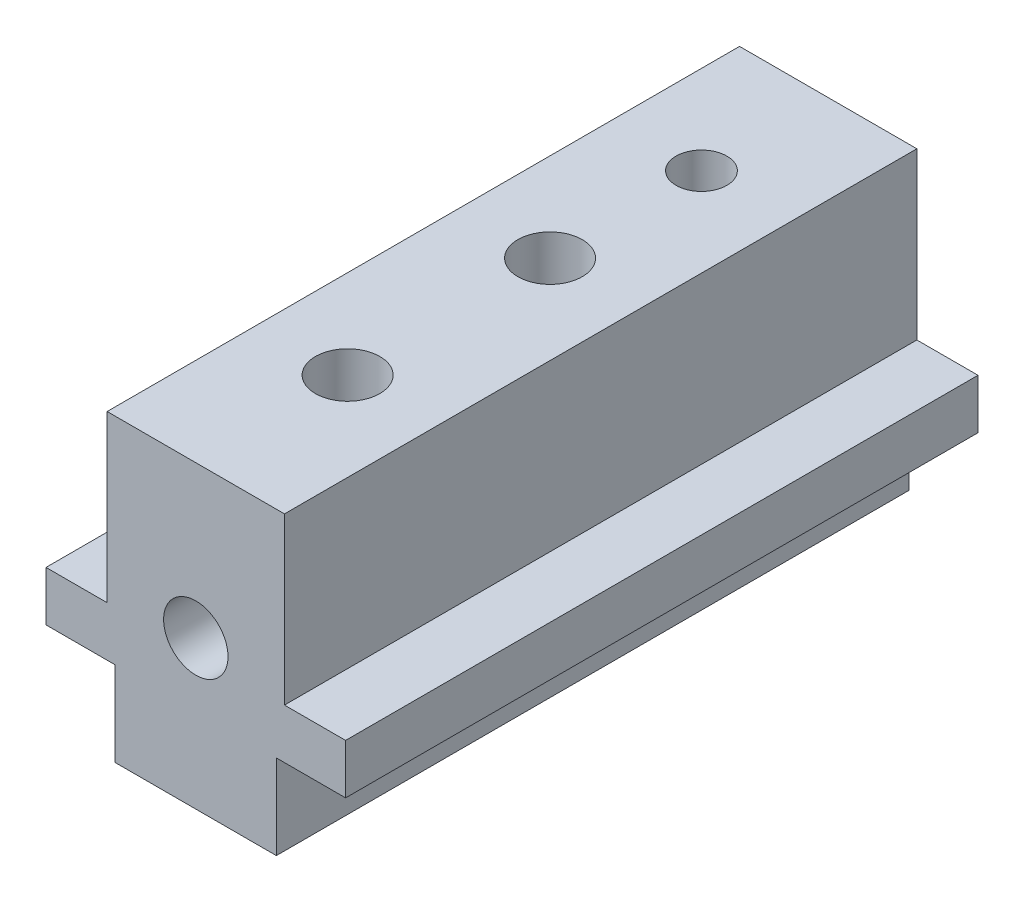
ISO-10303-21;
HEADER;
FILE_DESCRIPTION(('STEP AP214'),'2;1');
FILE_NAME('part.step','',(''),(''),'','','');
FILE_SCHEMA(('AUTOMOTIVE_DESIGN { 1 0 10303 214 1 1 1 1 }'));
ENDSEC;
DATA;
#1=APPLICATION_CONTEXT('core data for automotive mechanical design processes');
#2=APPLICATION_PROTOCOL_DEFINITION('international standard','automotive_design',2000,#1);
#3=PRODUCT_CONTEXT('',#1,'mechanical');
#4=PRODUCT('Part','Part','',(#3));
#5=PRODUCT_RELATED_PRODUCT_CATEGORY('part','',(#4));
#6=PRODUCT_DEFINITION_FORMATION('','',#4);
#7=PRODUCT_DEFINITION_CONTEXT('part definition',#1,'design');
#8=PRODUCT_DEFINITION('design','',#6,#7);
#9=PRODUCT_DEFINITION_SHAPE('','',#8);
#10=(LENGTH_UNIT() NAMED_UNIT(*) SI_UNIT(.MILLI.,.METRE.));
#11=(NAMED_UNIT(*) PLANE_ANGLE_UNIT() SI_UNIT($,.RADIAN.));
#12=(NAMED_UNIT(*) SI_UNIT($,.STERADIAN.) SOLID_ANGLE_UNIT());
#13=UNCERTAINTY_MEASURE_WITH_UNIT(LENGTH_MEASURE(1.E-05),#10,'distance_accuracy_value','');
#14=(GEOMETRIC_REPRESENTATION_CONTEXT(3) GLOBAL_UNCERTAINTY_ASSIGNED_CONTEXT((#13)) GLOBAL_UNIT_ASSIGNED_CONTEXT((#10,
#11,#12)) REPRESENTATION_CONTEXT('',''));
#15=CARTESIAN_POINT('',(0.,0.,0.));
#16=DIRECTION('',(0.,0.,1.));
#17=DIRECTION('',(1.,0.,0.));
#18=AXIS2_PLACEMENT_3D('',#15,#16,#17);
#19=CARTESIAN_POINT('',(0.,9.4107,10.3124));
#20=DIRECTION('',(0.,1.,0.));
#21=DIRECTION('',(0.,0.,1.));
#22=AXIS2_PLACEMENT_3D('',#19,#20,#21);
#23=CYLINDRICAL_SURFACE('',#22,2.0193);
#24=CARTESIAN_POINT('',(0.,9.4107,10.3124));
#25=DIRECTION('',(0.,1.,0.));
#26=DIRECTION('',(0.,0.,1.));
#27=AXIS2_PLACEMENT_3D('',#24,#25,#26);
#28=CIRCLE('',#27,2.0193);
#29=CARTESIAN_POINT('',(0.,9.4107,12.3317));
#30=VERTEX_POINT('',#29);
#31=EDGE_CURVE('E161',#30,#30,#28,.T.);
#32=ORIENTED_EDGE('',*,*,#31,.T.);
#33=EDGE_LOOP('',(#32));
#34=FACE_BOUND('',#33,.T.);
#35=CARTESIAN_POINT('',(0.,-0.114300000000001,10.3124));
#36=DIRECTION('',(0.,0.707106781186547,-0.707106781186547));
#37=DIRECTION('',(0.,0.707106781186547,0.707106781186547));
#38=AXIS2_PLACEMENT_3D('',#35,#36,#37);
#39=ELLIPSE('',#38,2.85572144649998,2.0193);
#40=CARTESIAN_POINT('',(2.0193,-0.114300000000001,10.3124));
#41=VERTEX_POINT('',#40);
#42=CARTESIAN_POINT('',(-2.0193,-0.114300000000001,10.3124));
#43=VERTEX_POINT('',#42);
#44=EDGE_CURVE('E49',#41,#43,#39,.F.);
#45=ORIENTED_EDGE('',*,*,#44,.T.);
#46=CARTESIAN_POINT('',(0.,-0.114300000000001,10.3124));
#47=DIRECTION('',(0.,0.707106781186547,0.707106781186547));
#48=DIRECTION('',(0.,0.707106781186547,-0.707106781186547));
#49=AXIS2_PLACEMENT_3D('',#46,#47,#48);
#50=ELLIPSE('',#49,2.85572144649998,2.0193);
#51=EDGE_CURVE('E11',#43,#41,#50,.F.);
#52=ORIENTED_EDGE('',*,*,#51,.T.);
#53=EDGE_LOOP('',(#45,#52));
#54=FACE_BOUND('',#53,.T.);
#55=ADVANCED_FACE('F36',(#34,#54),#23,.F.);
#56=CARTESIAN_POINT('',(-9.39799999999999,9.4107,-19.8374));
#57=DIRECTION('',(1.,0.,0.));
#58=DIRECTION('',(0.,0.,-1.));
#59=AXIS2_PLACEMENT_3D('',#56,#57,#58);
#60=PLANE('',#59);
#61=DIRECTION('',(0.,-1.,0.));
#62=VECTOR('',#61,1.);
#63=CARTESIAN_POINT('',(-9.39799999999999,9.4107,-19.8374));
#64=LINE('',#63,#62);
#65=CARTESIAN_POINT('',(-9.398,-0.977900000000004,-19.8374));
#66=VERTEX_POINT('',#65);
#67=CARTESIAN_POINT('',(-9.398,-4.1021,-19.8374));
#68=VERTEX_POINT('',#67);
#69=EDGE_CURVE('E249',#66,#68,#64,.T.);
#70=ORIENTED_EDGE('',*,*,#69,.T.);
#71=DIRECTION('',(0.,0.,1.));
#72=VECTOR('',#71,1.);
#73=CARTESIAN_POINT('',(-9.398,-4.1021,-19.8374));
#74=LINE('',#73,#72);
#75=CARTESIAN_POINT('',(-9.398,-4.1021,19.8374));
#76=VERTEX_POINT('',#75);
#77=EDGE_CURVE('E198',#68,#76,#74,.T.);
#78=ORIENTED_EDGE('',*,*,#77,.T.);
#79=DIRECTION('',(0.,-1.,0.));
#80=VECTOR('',#79,1.);
#81=CARTESIAN_POINT('',(-9.398,9.4107,19.8374));
#82=LINE('',#81,#80);
#83=CARTESIAN_POINT('',(-9.398,-0.977900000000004,19.8374));
#84=VERTEX_POINT('',#83);
#85=EDGE_CURVE('E259',#84,#76,#82,.T.);
#86=ORIENTED_EDGE('',*,*,#85,.F.);
#87=DIRECTION('',(0.,0.,1.));
#88=VECTOR('',#87,1.);
#89=CARTESIAN_POINT('',(-9.398,-0.977900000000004,-19.8374));
#90=LINE('',#89,#88);
#91=EDGE_CURVE('E232',#66,#84,#90,.T.);
#92=ORIENTED_EDGE('',*,*,#91,.F.);
#93=EDGE_LOOP('',(#70,#78,#86,#92));
#94=FACE_BOUND('',#93,.T.);
#95=ADVANCED_FACE('F38',(#94),#60,.F.);
#96=CARTESIAN_POINT('',(-9.398,9.4107,19.8374));
#97=DIRECTION('',(0.,0.,-1.));
#98=DIRECTION('',(-1.,0.,0.));
#99=AXIS2_PLACEMENT_3D('',#96,#97,#98);
#100=PLANE('',#99);
#101=CARTESIAN_POINT('',(0.,-0.114300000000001,19.8374));
#102=DIRECTION('',(0.,0.,1.));
#103=DIRECTION('',(1.,0.,0.));
#104=AXIS2_PLACEMENT_3D('',#101,#102,#103);
#105=CIRCLE('',#104,2.01929999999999);
#106=CARTESIAN_POINT('',(2.01929999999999,-0.114300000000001,19.8374));
#107=VERTEX_POINT('',#106);
#108=EDGE_CURVE('E148',#107,#107,#105,.T.);
#109=ORIENTED_EDGE('',*,*,#108,.F.);
#110=EDGE_LOOP('',(#109));
#111=FACE_BOUND('',#110,.T.);
#112=DIRECTION('',(0.,-1.,0.));
#113=VECTOR('',#112,1.);
#114=CARTESIAN_POINT('',(9.398,9.4107,19.8374));
#115=LINE('',#114,#113);
#116=CARTESIAN_POINT('',(9.398,-0.9779,19.8374));
#117=VERTEX_POINT('',#116);
#118=CARTESIAN_POINT('',(9.398,-4.1021,19.8374));
#119=VERTEX_POINT('',#118);
#120=EDGE_CURVE('E257',#117,#119,#115,.T.);
#121=ORIENTED_EDGE('',*,*,#120,.F.);
#122=DIRECTION('',(1.,0.,0.));
#123=VECTOR('',#122,1.);
#124=CARTESIAN_POINT('',(5.5626,-0.977900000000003,19.8374));
#125=LINE('',#124,#123);
#126=CARTESIAN_POINT('',(5.5626,-0.977900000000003,19.8374));
#127=VERTEX_POINT('',#126);
#128=EDGE_CURVE('E173',#127,#117,#125,.T.);
#129=ORIENTED_EDGE('',*,*,#128,.F.);
#130=DIRECTION('',(0.,-1.,0.));
#131=VECTOR('',#130,1.);
#132=CARTESIAN_POINT('',(5.5626,9.4107,19.8374));
#133=LINE('',#132,#131);
#134=CARTESIAN_POINT('',(5.5626,9.4107,19.8374));
#135=VERTEX_POINT('',#134);
#136=EDGE_CURVE('E170',#135,#127,#133,.T.);
#137=ORIENTED_EDGE('',*,*,#136,.F.);
#138=DIRECTION('',(1.,0.,0.));
#139=VECTOR('',#138,1.);
#140=CARTESIAN_POINT('',(-9.398,9.4107,19.8374));
#141=LINE('',#140,#139);
#142=CARTESIAN_POINT('',(-5.5626,9.4107,19.8374));
#143=VERTEX_POINT('',#142);
#144=EDGE_CURVE('E243',#143,#135,#141,.T.);
#145=ORIENTED_EDGE('',*,*,#144,.F.);
#146=DIRECTION('',(0.,1.,0.));
#147=VECTOR('',#146,1.);
#148=CARTESIAN_POINT('',(-5.5626,9.4107,19.8374));
#149=LINE('',#148,#147);
#150=CARTESIAN_POINT('',(-5.5626,-0.977900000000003,19.8374));
#151=VERTEX_POINT('',#150);
#152=EDGE_CURVE('E229',#151,#143,#149,.T.);
#153=ORIENTED_EDGE('',*,*,#152,.F.);
#154=DIRECTION('',(1.,0.,0.));
#155=VECTOR('',#154,1.);
#156=CARTESIAN_POINT('',(-9.398,-0.977900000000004,19.8374));
#157=LINE('',#156,#155);
#158=EDGE_CURVE('E219',#84,#151,#157,.T.);
#159=ORIENTED_EDGE('',*,*,#158,.F.);
#160=ORIENTED_EDGE('',*,*,#85,.T.);
#161=DIRECTION('',(-1.,0.,0.));
#162=VECTOR('',#161,1.);
#163=CARTESIAN_POINT('',(-9.398,-4.1021,19.8374));
#164=LINE('',#163,#162);
#165=CARTESIAN_POINT('',(-5.0546,-4.1021,19.8374));
#166=VERTEX_POINT('',#165);
#167=EDGE_CURVE('E191',#166,#76,#164,.T.);
#168=ORIENTED_EDGE('',*,*,#167,.F.);
#169=DIRECTION('',(0.,1.,0.));
#170=VECTOR('',#169,1.);
#171=CARTESIAN_POINT('',(-5.0546,-4.1021,19.8374));
#172=LINE('',#171,#170);
#173=CARTESIAN_POINT('',(-5.0546,-9.4107,19.8374));
#174=VERTEX_POINT('',#173);
#175=EDGE_CURVE('E183',#174,#166,#172,.T.);
#176=ORIENTED_EDGE('',*,*,#175,.F.);
#177=DIRECTION('',(1.,0.,0.));
#178=VECTOR('',#177,1.);
#179=CARTESIAN_POINT('',(-9.398,-9.4107,19.8374));
#180=LINE('',#179,#178);
#181=CARTESIAN_POINT('',(5.0546,-9.4107,19.8374));
#182=VERTEX_POINT('',#181);
#183=EDGE_CURVE('E239',#174,#182,#180,.T.);
#184=ORIENTED_EDGE('',*,*,#183,.T.);
#185=DIRECTION('',(0.,-1.,0.));
#186=VECTOR('',#185,1.);
#187=CARTESIAN_POINT('',(5.0546,-4.1021,19.8374));
#188=LINE('',#187,#186);
#189=CARTESIAN_POINT('',(5.0546,-4.1021,19.8374));
#190=VERTEX_POINT('',#189);
#191=EDGE_CURVE('E201',#190,#182,#188,.T.);
#192=ORIENTED_EDGE('',*,*,#191,.F.);
#193=DIRECTION('',(-1.,0.,0.));
#194=VECTOR('',#193,1.);
#195=CARTESIAN_POINT('',(5.0546,-4.1021,19.8374));
#196=LINE('',#195,#194);
#197=EDGE_CURVE('E209',#119,#190,#196,.T.);
#198=ORIENTED_EDGE('',*,*,#197,.F.);
#199=EDGE_LOOP('',(#121,#129,#137,#145,#153,#159,#160,#168,#176,#184,#192,#198));
#200=FACE_BOUND('',#199,.T.);
#201=ADVANCED_FACE('F279',(#111,#200),#100,.F.);
#202=CARTESIAN_POINT('',(9.398,9.4107,-19.8374));
#203=DIRECTION('',(-1.,0.,0.));
#204=DIRECTION('',(0.,0.,1.));
#205=AXIS2_PLACEMENT_3D('',#202,#203,#204);
#206=PLANE('',#205);
#207=DIRECTION('',(0.,-1.,0.));
#208=VECTOR('',#207,1.);
#209=CARTESIAN_POINT('',(9.398,9.4107,-19.8374));
#210=LINE('',#209,#208);
#211=CARTESIAN_POINT('',(9.398,-0.9779,-19.8374));
#212=VERTEX_POINT('',#211);
#213=CARTESIAN_POINT('',(9.398,-4.1021,-19.8374));
#214=VERTEX_POINT('',#213);
#215=EDGE_CURVE('E255',#212,#214,#210,.T.);
#216=ORIENTED_EDGE('',*,*,#215,.F.);
#217=DIRECTION('',(0.,0.,1.));
#218=VECTOR('',#217,1.);
#219=CARTESIAN_POINT('',(9.398,-0.9779,-19.8374));
#220=LINE('',#219,#218);
#221=EDGE_CURVE('E180',#212,#117,#220,.T.);
#222=ORIENTED_EDGE('',*,*,#221,.T.);
#223=ORIENTED_EDGE('',*,*,#120,.T.);
#224=DIRECTION('',(0.,0.,1.));
#225=VECTOR('',#224,1.);
#226=CARTESIAN_POINT('',(9.398,-4.1021,-19.8374));
#227=LINE('',#226,#225);
#228=EDGE_CURVE('E220',#214,#119,#227,.T.);
#229=ORIENTED_EDGE('',*,*,#228,.F.);
#230=EDGE_LOOP('',(#216,#222,#223,#229));
#231=FACE_BOUND('',#230,.T.);
#232=ADVANCED_FACE('F343',(#231),#206,.F.);
#233=CARTESIAN_POINT('',(-9.39799999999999,9.4107,-19.8374));
#234=DIRECTION('',(0.,0.,1.));
#235=DIRECTION('',(1.,0.,0.));
#236=AXIS2_PLACEMENT_3D('',#233,#234,#235);
#237=PLANE('',#236);
#238=DIRECTION('',(0.,-1.,0.));
#239=VECTOR('',#238,1.);
#240=CARTESIAN_POINT('',(5.5626,9.4107,-19.8374));
#241=LINE('',#240,#239);
#242=CARTESIAN_POINT('',(5.5626,9.4107,-19.8374));
#243=VERTEX_POINT('',#242);
#244=CARTESIAN_POINT('',(5.5626,-0.977900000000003,-19.8374));
#245=VERTEX_POINT('',#244);
#246=EDGE_CURVE('E57',#243,#245,#241,.T.);
#247=ORIENTED_EDGE('',*,*,#246,.T.);
#248=DIRECTION('',(1.,0.,0.));
#249=VECTOR('',#248,1.);
#250=CARTESIAN_POINT('',(5.5626,-0.977900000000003,-19.8374));
#251=LINE('',#250,#249);
#252=EDGE_CURVE('E172',#245,#212,#251,.T.);
#253=ORIENTED_EDGE('',*,*,#252,.T.);
#254=ORIENTED_EDGE('',*,*,#215,.T.);
#255=DIRECTION('',(-1.,0.,0.));
#256=VECTOR('',#255,1.);
#257=CARTESIAN_POINT('',(5.0546,-4.1021,-19.8374));
#258=LINE('',#257,#256);
#259=CARTESIAN_POINT('',(5.0546,-4.1021,-19.8374));
#260=VERTEX_POINT('',#259);
#261=EDGE_CURVE('E208',#214,#260,#258,.T.);
#262=ORIENTED_EDGE('',*,*,#261,.T.);
#263=DIRECTION('',(0.,-1.,0.));
#264=VECTOR('',#263,1.);
#265=CARTESIAN_POINT('',(5.0546,-4.1021,-19.8374));
#266=LINE('',#265,#264);
#267=CARTESIAN_POINT('',(5.0546,-9.4107,-19.8374));
#268=VERTEX_POINT('',#267);
#269=EDGE_CURVE('E205',#260,#268,#266,.T.);
#270=ORIENTED_EDGE('',*,*,#269,.T.);
#271=DIRECTION('',(-1.,0.,0.));
#272=VECTOR('',#271,1.);
#273=CARTESIAN_POINT('',(-9.39799999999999,-9.4107,-19.8374));
#274=LINE('',#273,#272);
#275=CARTESIAN_POINT('',(-5.0546,-9.4107,-19.8374));
#276=VERTEX_POINT('',#275);
#277=EDGE_CURVE('E247',#268,#276,#274,.T.);
#278=ORIENTED_EDGE('',*,*,#277,.T.);
#279=DIRECTION('',(0.,1.,0.));
#280=VECTOR('',#279,1.);
#281=CARTESIAN_POINT('',(-5.0546,-4.1021,-19.8374));
#282=LINE('',#281,#280);
#283=CARTESIAN_POINT('',(-5.0546,-4.1021,-19.8374));
#284=VERTEX_POINT('',#283);
#285=EDGE_CURVE('E187',#276,#284,#282,.T.);
#286=ORIENTED_EDGE('',*,*,#285,.T.);
#287=DIRECTION('',(-1.,0.,0.));
#288=VECTOR('',#287,1.);
#289=CARTESIAN_POINT('',(-9.398,-4.1021,-19.8374));
#290=LINE('',#289,#288);
#291=EDGE_CURVE('E190',#284,#68,#290,.T.);
#292=ORIENTED_EDGE('',*,*,#291,.T.);
#293=ORIENTED_EDGE('',*,*,#69,.F.);
#294=DIRECTION('',(1.,0.,0.));
#295=VECTOR('',#294,1.);
#296=CARTESIAN_POINT('',(-9.398,-0.977900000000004,-19.8374));
#297=LINE('',#296,#295);
#298=CARTESIAN_POINT('',(-5.5626,-0.977900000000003,-19.8374));
#299=VERTEX_POINT('',#298);
#300=EDGE_CURVE('E225',#66,#299,#297,.T.);
#301=ORIENTED_EDGE('',*,*,#300,.T.);
#302=DIRECTION('',(0.,1.,0.));
#303=VECTOR('',#302,1.);
#304=CARTESIAN_POINT('',(-5.5626,9.4107,-19.8374));
#305=LINE('',#304,#303);
#306=CARTESIAN_POINT('',(-5.5626,9.4107,-19.8374));
#307=VERTEX_POINT('',#306);
#308=EDGE_CURVE('E228',#299,#307,#305,.T.);
#309=ORIENTED_EDGE('',*,*,#308,.T.);
#310=DIRECTION('',(-1.,0.,0.));
#311=VECTOR('',#310,1.);
#312=CARTESIAN_POINT('',(-9.39799999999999,9.4107,-19.8374));
#313=LINE('',#312,#311);
#314=EDGE_CURVE('E246',#243,#307,#313,.T.);
#315=ORIENTED_EDGE('',*,*,#314,.F.);
#316=EDGE_LOOP('',(#247,#253,#254,#262,#270,#278,#286,#292,#293,#301,#309,#315));
#317=FACE_BOUND('',#316,.T.);
#318=ADVANCED_FACE('F315',(#317),#237,.F.);
#319=CARTESIAN_POINT('',(-9.398,9.4107,19.8374));
#320=DIRECTION('',(0.,1.,0.));
#321=DIRECTION('',(0.,0.,1.));
#322=AXIS2_PLACEMENT_3D('',#319,#320,#321);
#323=PLANE('',#322);
#324=CARTESIAN_POINT('',(0.,9.4107,-11.8872));
#325=DIRECTION('',(0.,1.,0.));
#326=DIRECTION('',(0.,0.,1.));
#327=AXIS2_PLACEMENT_3D('',#324,#325,#326);
#328=CIRCLE('',#327,1.59385);
#329=CARTESIAN_POINT('',(0.,9.4107,-10.29335));
#330=VERTEX_POINT('',#329);
#331=EDGE_CURVE('E155',#330,#330,#328,.T.);
#332=ORIENTED_EDGE('',*,*,#331,.F.);
#333=EDGE_LOOP('',(#332));
#334=FACE_BOUND('',#333,.T.);
#335=ORIENTED_EDGE('',*,*,#31,.F.);
#336=EDGE_LOOP('',(#335));
#337=FACE_BOUND('',#336,.T.);
#338=CARTESIAN_POINT('',(0.,9.4107,-2.3876));
#339=DIRECTION('',(0.,1.,0.));
#340=DIRECTION('',(0.,0.,1.));
#341=AXIS2_PLACEMENT_3D('',#338,#339,#340);
#342=CIRCLE('',#341,2.0193);
#343=CARTESIAN_POINT('',(0.,9.4107,-0.368299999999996));
#344=VERTEX_POINT('',#343);
#345=EDGE_CURVE('E167',#344,#344,#342,.T.);
#346=ORIENTED_EDGE('',*,*,#345,.F.);
#347=EDGE_LOOP('',(#346));
#348=FACE_BOUND('',#347,.T.);
#349=DIRECTION('',(0.,0.,1.));
#350=VECTOR('',#349,1.);
#351=CARTESIAN_POINT('',(5.5626,9.4107,-19.8374));
#352=LINE('',#351,#350);
#353=EDGE_CURVE('E176',#243,#135,#352,.T.);
#354=ORIENTED_EDGE('',*,*,#353,.F.);
#355=ORIENTED_EDGE('',*,*,#314,.T.);
#356=DIRECTION('',(0.,0.,1.));
#357=VECTOR('',#356,1.);
#358=CARTESIAN_POINT('',(-5.5626,9.4107,-19.8374));
#359=LINE('',#358,#357);
#360=EDGE_CURVE('E236',#307,#143,#359,.T.);
#361=ORIENTED_EDGE('',*,*,#360,.T.);
#362=ORIENTED_EDGE('',*,*,#144,.T.);
#363=EDGE_LOOP('',(#354,#355,#361,#362));
#364=FACE_BOUND('',#363,.T.);
#365=ADVANCED_FACE('F311',(#334,#337,#348,#364),#323,.T.);
#366=CARTESIAN_POINT('',(-9.398,-9.4107,19.8374));
#367=DIRECTION('',(0.,1.,0.));
#368=DIRECTION('',(0.,0.,1.));
#369=AXIS2_PLACEMENT_3D('',#366,#367,#368);
#370=PLANE('',#369);
#371=ORIENTED_EDGE('',*,*,#183,.F.);
#372=DIRECTION('',(0.,0.,1.));
#373=VECTOR('',#372,1.);
#374=CARTESIAN_POINT('',(-5.0546,-9.4107,-19.8374));
#375=LINE('',#374,#373);
#376=EDGE_CURVE('E194',#276,#174,#375,.T.);
#377=ORIENTED_EDGE('',*,*,#376,.F.);
#378=ORIENTED_EDGE('',*,*,#277,.F.);
#379=DIRECTION('',(0.,0.,1.));
#380=VECTOR('',#379,1.);
#381=CARTESIAN_POINT('',(5.0546,-9.4107,-19.8374));
#382=LINE('',#381,#380);
#383=EDGE_CURVE('E212',#268,#182,#382,.T.);
#384=ORIENTED_EDGE('',*,*,#383,.T.);
#385=EDGE_LOOP('',(#371,#377,#378,#384));
#386=FACE_BOUND('',#385,.T.);
#387=ADVANCED_FACE('F314',(#386),#370,.F.);
#388=CARTESIAN_POINT('',(-5.5626,9.4107,-19.8374));
#389=DIRECTION('',(1.,0.,0.));
#390=DIRECTION('',(0.,1.,0.));
#391=AXIS2_PLACEMENT_3D('',#388,#389,#390);
#392=PLANE('',#391);
#393=ORIENTED_EDGE('',*,*,#152,.T.);
#394=ORIENTED_EDGE('',*,*,#360,.F.);
#395=ORIENTED_EDGE('',*,*,#308,.F.);
#396=DIRECTION('',(0.,0.,1.));
#397=VECTOR('',#396,1.);
#398=CARTESIAN_POINT('',(-5.5626,-0.977900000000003,-19.8374));
#399=LINE('',#398,#397);
#400=EDGE_CURVE('E240',#299,#151,#399,.T.);
#401=ORIENTED_EDGE('',*,*,#400,.T.);
#402=EDGE_LOOP('',(#393,#394,#395,#401));
#403=FACE_BOUND('',#402,.T.);
#404=ADVANCED_FACE('F329',(#403),#392,.F.);
#405=CARTESIAN_POINT('',(-9.398,-0.977900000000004,-19.8374));
#406=DIRECTION('',(0.,-1.,0.));
#407=DIRECTION('',(1.,0.,0.));
#408=AXIS2_PLACEMENT_3D('',#405,#406,#407);
#409=PLANE('',#408);
#410=ORIENTED_EDGE('',*,*,#158,.T.);
#411=ORIENTED_EDGE('',*,*,#400,.F.);
#412=ORIENTED_EDGE('',*,*,#300,.F.);
#413=ORIENTED_EDGE('',*,*,#91,.T.);
#414=EDGE_LOOP('',(#410,#411,#412,#413));
#415=FACE_BOUND('',#414,.T.);
#416=ADVANCED_FACE('F365',(#415),#409,.F.);
#417=CARTESIAN_POINT('',(5.0546,-4.1021,-19.8374));
#418=DIRECTION('',(-1.,0.,0.));
#419=DIRECTION('',(0.,-1.,0.));
#420=AXIS2_PLACEMENT_3D('',#417,#418,#419);
#421=PLANE('',#420);
#422=ORIENTED_EDGE('',*,*,#191,.T.);
#423=ORIENTED_EDGE('',*,*,#383,.F.);
#424=ORIENTED_EDGE('',*,*,#269,.F.);
#425=DIRECTION('',(0.,0.,1.));
#426=VECTOR('',#425,1.);
#427=CARTESIAN_POINT('',(5.0546,-4.1021,-19.8374));
#428=LINE('',#427,#426);
#429=EDGE_CURVE('E217',#260,#190,#428,.T.);
#430=ORIENTED_EDGE('',*,*,#429,.T.);
#431=EDGE_LOOP('',(#422,#423,#424,#430));
#432=FACE_BOUND('',#431,.T.);
#433=ADVANCED_FACE('F351',(#432),#421,.F.);
#434=CARTESIAN_POINT('',(5.0546,-4.1021,-19.8374));
#435=DIRECTION('',(0.,1.,0.));
#436=DIRECTION('',(-1.,0.,0.));
#437=AXIS2_PLACEMENT_3D('',#434,#435,#436);
#438=PLANE('',#437);
#439=ORIENTED_EDGE('',*,*,#197,.T.);
#440=ORIENTED_EDGE('',*,*,#429,.F.);
#441=ORIENTED_EDGE('',*,*,#261,.F.);
#442=ORIENTED_EDGE('',*,*,#228,.T.);
#443=EDGE_LOOP('',(#439,#440,#441,#442));
#444=FACE_BOUND('',#443,.T.);
#445=ADVANCED_FACE('F346',(#444),#438,.F.);
#446=CARTESIAN_POINT('',(-9.398,-4.1021,-19.8374));
#447=DIRECTION('',(0.,1.,0.));
#448=DIRECTION('',(-1.,0.,0.));
#449=AXIS2_PLACEMENT_3D('',#446,#447,#448);
#450=PLANE('',#449);
#451=ORIENTED_EDGE('',*,*,#167,.T.);
#452=ORIENTED_EDGE('',*,*,#77,.F.);
#453=ORIENTED_EDGE('',*,*,#291,.F.);
#454=DIRECTION('',(0.,0.,1.));
#455=VECTOR('',#454,1.);
#456=CARTESIAN_POINT('',(-5.0546,-4.1021,-19.8374));
#457=LINE('',#456,#455);
#458=EDGE_CURVE('E202',#284,#166,#457,.T.);
#459=ORIENTED_EDGE('',*,*,#458,.T.);
#460=EDGE_LOOP('',(#451,#452,#453,#459));
#461=FACE_BOUND('',#460,.T.);
#462=ADVANCED_FACE('F361',(#461),#450,.F.);
#463=CARTESIAN_POINT('',(-5.0546,-4.1021,-19.8374));
#464=DIRECTION('',(1.,0.,0.));
#465=DIRECTION('',(0.,1.,0.));
#466=AXIS2_PLACEMENT_3D('',#463,#464,#465);
#467=PLANE('',#466);
#468=ORIENTED_EDGE('',*,*,#175,.T.);
#469=ORIENTED_EDGE('',*,*,#458,.F.);
#470=ORIENTED_EDGE('',*,*,#285,.F.);
#471=ORIENTED_EDGE('',*,*,#376,.T.);
#472=EDGE_LOOP('',(#468,#469,#470,#471));
#473=FACE_BOUND('',#472,.T.);
#474=ADVANCED_FACE('F358',(#473),#467,.F.);
#475=CARTESIAN_POINT('',(5.5626,-0.977900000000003,-19.8374));
#476=DIRECTION('',(0.,-1.,0.));
#477=DIRECTION('',(1.,0.,0.));
#478=AXIS2_PLACEMENT_3D('',#475,#476,#477);
#479=PLANE('',#478);
#480=ORIENTED_EDGE('',*,*,#128,.T.);
#481=ORIENTED_EDGE('',*,*,#221,.F.);
#482=ORIENTED_EDGE('',*,*,#252,.F.);
#483=DIRECTION('',(0.,0.,1.));
#484=VECTOR('',#483,1.);
#485=CARTESIAN_POINT('',(5.5626,-0.977900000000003,-19.8374));
#486=LINE('',#485,#484);
#487=EDGE_CURVE('E184',#245,#127,#486,.T.);
#488=ORIENTED_EDGE('',*,*,#487,.T.);
#489=EDGE_LOOP('',(#480,#481,#482,#488));
#490=FACE_BOUND('',#489,.T.);
#491=ADVANCED_FACE('F338',(#490),#479,.F.);
#492=CARTESIAN_POINT('',(5.5626,9.4107,-19.8374));
#493=DIRECTION('',(-1.,0.,0.));
#494=DIRECTION('',(0.,-1.,0.));
#495=AXIS2_PLACEMENT_3D('',#492,#493,#494);
#496=PLANE('',#495);
#497=ORIENTED_EDGE('',*,*,#136,.T.);
#498=ORIENTED_EDGE('',*,*,#487,.F.);
#499=ORIENTED_EDGE('',*,*,#246,.F.);
#500=ORIENTED_EDGE('',*,*,#353,.T.);
#501=EDGE_LOOP('',(#497,#498,#499,#500));
#502=FACE_BOUND('',#501,.T.);
#503=ADVANCED_FACE('F335',(#502),#496,.F.);
#504=CARTESIAN_POINT('',(0.,9.4107,-2.3876));
#505=DIRECTION('',(0.,1.,0.));
#506=DIRECTION('',(0.,0.,1.));
#507=AXIS2_PLACEMENT_3D('',#504,#505,#506);
#508=CYLINDRICAL_SURFACE('',#507,2.0193);
#509=CARTESIAN_POINT('',(0.,-2.4765,-2.3876));
#510=DIRECTION('',(0.,1.,0.));
#511=DIRECTION('',(0.,0.,1.));
#512=AXIS2_PLACEMENT_3D('',#509,#510,#511);
#513=CIRCLE('',#512,2.0193);
#514=CARTESIAN_POINT('',(0.,-2.4765,-0.368299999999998));
#515=VERTEX_POINT('',#514);
#516=EDGE_CURVE('E164',#515,#515,#513,.T.);
#517=ORIENTED_EDGE('',*,*,#516,.F.);
#518=EDGE_LOOP('',(#517));
#519=FACE_BOUND('',#518,.T.);
#520=ORIENTED_EDGE('',*,*,#345,.T.);
#521=EDGE_LOOP('',(#520));
#522=FACE_BOUND('',#521,.T.);
#523=ADVANCED_FACE('F462',(#519,#522),#508,.F.);
#524=CARTESIAN_POINT('',(0.,-2.4765,-2.3876));
#525=DIRECTION('',(0.,1.,0.));
#526=DIRECTION('',(0.,0.,1.));
#527=AXIS2_PLACEMENT_3D('',#524,#525,#526);
#528=CONICAL_SURFACE('',#527,2.0193,1.02974425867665);
#529=CARTESIAN_POINT('',(0.,-3.68981784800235,-2.3876));
#530=VERTEX_POINT('',#529);
#531=VERTEX_LOOP('',#530);
#532=FACE_BOUND('',#531,.T.);
#533=ORIENTED_EDGE('',*,*,#516,.T.);
#534=EDGE_LOOP('',(#533));
#535=FACE_BOUND('',#534,.T.);
#536=ADVANCED_FACE('F294',(#532,#535),#528,.F.);
#537=CARTESIAN_POINT('',(0.,-0.114300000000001,19.8374));
#538=DIRECTION('',(0.,0.,1.));
#539=DIRECTION('',(1.,0.,0.));
#540=AXIS2_PLACEMENT_3D('',#537,#538,#539);
#541=CYLINDRICAL_SURFACE('',#540,2.01929999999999);
#542=ORIENTED_EDGE('',*,*,#108,.T.);
#543=EDGE_LOOP('',(#542));
#544=FACE_BOUND('',#543,.T.);
#545=ORIENTED_EDGE('',*,*,#44,.F.);
#546=CARTESIAN_POINT('',(0.,-0.114300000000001,10.3124));
#547=DIRECTION('',(0.,0.707106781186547,0.707106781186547));
#548=DIRECTION('',(0.,0.707106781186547,-0.707106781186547));
#549=AXIS2_PLACEMENT_3D('',#546,#547,#548);
#550=ELLIPSE('',#549,2.85572144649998,2.0193);
#551=EDGE_CURVE('E44',#43,#41,#550,.T.);
#552=ORIENTED_EDGE('',*,*,#551,.F.);
#553=EDGE_LOOP('',(#545,#552));
#554=FACE_BOUND('',#553,.T.);
#555=ADVANCED_FACE('F271',(#544,#554),#541,.F.);
#556=CARTESIAN_POINT('',(0.,-2.4765,10.3124));
#557=DIRECTION('',(0.,1.,0.));
#558=DIRECTION('',(0.,0.,1.));
#559=AXIS2_PLACEMENT_3D('',#556,#557,#558);
#560=CONICAL_SURFACE('',#559,2.0193,1.02974425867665);
#561=CARTESIAN_POINT('',(0.,-3.68981784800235,10.3124));
#562=VERTEX_POINT('',#561);
#563=VERTEX_LOOP('',#562);
#564=FACE_BOUND('',#563,.T.);
#565=CARTESIAN_POINT('',(0.,-2.4765,10.3124));
#566=DIRECTION('',(0.,1.,0.));
#567=DIRECTION('',(0.,0.,1.));
#568=AXIS2_PLACEMENT_3D('',#565,#566,#567);
#569=CIRCLE('',#568,2.0193);
#570=CARTESIAN_POINT('',(0.,-2.4765,12.3317));
#571=VERTEX_POINT('',#570);
#572=EDGE_CURVE('E152',#571,#571,#569,.T.);
#573=ORIENTED_EDGE('',*,*,#572,.T.);
#574=EDGE_LOOP('',(#573));
#575=FACE_BOUND('',#574,.T.);
#576=ADVANCED_FACE('F284',(#564,#575),#560,.F.);
#577=CARTESIAN_POINT('',(0.,-0.114300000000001,10.3124));
#578=DIRECTION('',(0.,0.707106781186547,-0.707106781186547));
#579=DIRECTION('',(0.,0.707106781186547,0.707106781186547));
#580=AXIS2_PLACEMENT_3D('',#577,#578,#579);
#581=ELLIPSE('',#580,2.85572144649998,2.0193);
#582=EDGE_CURVE('E263',#41,#43,#581,.T.);
#583=ORIENTED_EDGE('',*,*,#582,.T.);
#584=ORIENTED_EDGE('',*,*,#551,.T.);
#585=EDGE_LOOP('',(#583,#584));
#586=FACE_BOUND('',#585,.T.);
#587=ORIENTED_EDGE('',*,*,#572,.F.);
#588=EDGE_LOOP('',(#587));
#589=FACE_BOUND('',#588,.T.);
#590=ADVANCED_FACE('F267',(#586,#589),#23,.F.);
#591=CARTESIAN_POINT('',(0.,-0.114300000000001,7.9504032));
#592=DIRECTION('',(0.,0.,1.));
#593=DIRECTION('',(1.,0.,0.));
#594=AXIS2_PLACEMENT_3D('',#591,#592,#593);
#595=CIRCLE('',#594,2.0193);
#596=CARTESIAN_POINT('',(2.0193,-0.114300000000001,7.9504032));
#597=VERTEX_POINT('',#596);
#598=EDGE_CURVE('E146',#597,#597,#595,.T.);
#599=ORIENTED_EDGE('',*,*,#598,.F.);
#600=EDGE_LOOP('',(#599));
#601=FACE_BOUND('',#600,.T.);
#602=ORIENTED_EDGE('',*,*,#582,.F.);
#603=ORIENTED_EDGE('',*,*,#51,.F.);
#604=EDGE_LOOP('',(#602,#603));
#605=FACE_BOUND('',#604,.T.);
#606=ADVANCED_FACE('F142',(#601,#605),#541,.F.);
#607=CARTESIAN_POINT('',(0.,-0.114300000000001,7.9504032));
#608=DIRECTION('',(0.,0.,1.));
#609=DIRECTION('',(1.,0.,0.));
#610=AXIS2_PLACEMENT_3D('',#607,#608,#609);
#611=CONICAL_SURFACE('',#610,2.0193,1.02974425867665);
#612=CARTESIAN_POINT('',(0.,-0.114300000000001,6.73708535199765));
#613=VERTEX_POINT('',#612);
#614=VERTEX_LOOP('',#613);
#615=FACE_BOUND('',#614,.T.);
#616=ORIENTED_EDGE('',*,*,#598,.T.);
#617=EDGE_LOOP('',(#616));
#618=FACE_BOUND('',#617,.T.);
#619=ADVANCED_FACE('F138',(#615,#618),#611,.F.);
#620=CARTESIAN_POINT('',(0.,3.0607,-11.8872));
#621=DIRECTION('',(0.,1.,0.));
#622=DIRECTION('',(0.,0.,1.));
#623=AXIS2_PLACEMENT_3D('',#620,#621,#622);
#624=CYLINDRICAL_SURFACE('',#623,1.59385);
#625=CARTESIAN_POINT('',(0.,3.0607,-11.8872));
#626=DIRECTION('',(0.,1.,0.));
#627=DIRECTION('',(0.,0.,1.));
#628=AXIS2_PLACEMENT_3D('',#625,#626,#627);
#629=CIRCLE('',#628,1.59385);
#630=CARTESIAN_POINT('',(0.,3.0607,-10.29335));
#631=VERTEX_POINT('',#630);
#632=EDGE_CURVE('E149',#631,#631,#629,.T.);
#633=ORIENTED_EDGE('',*,*,#632,.F.);
#634=EDGE_LOOP('',(#633));
#635=FACE_BOUND('',#634,.T.);
#636=ORIENTED_EDGE('',*,*,#331,.T.);
#637=EDGE_LOOP('',(#636));
#638=FACE_BOUND('',#637,.T.);
#639=ADVANCED_FACE('F141',(#635,#638),#624,.F.);
#640=CARTESIAN_POINT('',(0.,3.0607,-11.8872));
#641=DIRECTION('',(0.,1.,0.));
#642=DIRECTION('',(0.,0.,1.));
#643=AXIS2_PLACEMENT_3D('',#640,#641,#642);
#644=PLANE('',#643);
#645=ORIENTED_EDGE('',*,*,#632,.T.);
#646=EDGE_LOOP('',(#645));
#647=FACE_BOUND('',#646,.T.);
#648=ADVANCED_FACE('F300',(#647),#644,.T.);
#649=CLOSED_SHELL('',(#55,#95,#201,#232,#318,#365,#387,#404,#416,#433,#445,#462,#474,#491,#503,
#523,#536,#555,#576,#590,#606,#619,#639,#648));
#650=MANIFOLD_SOLID_BREP('B2',#649);
#651=ADVANCED_BREP_SHAPE_REPRESENTATION('',(#18,#650),#14);
#652=SHAPE_DEFINITION_REPRESENTATION(#9,#651);
ENDSEC;
END-ISO-10303-21;
